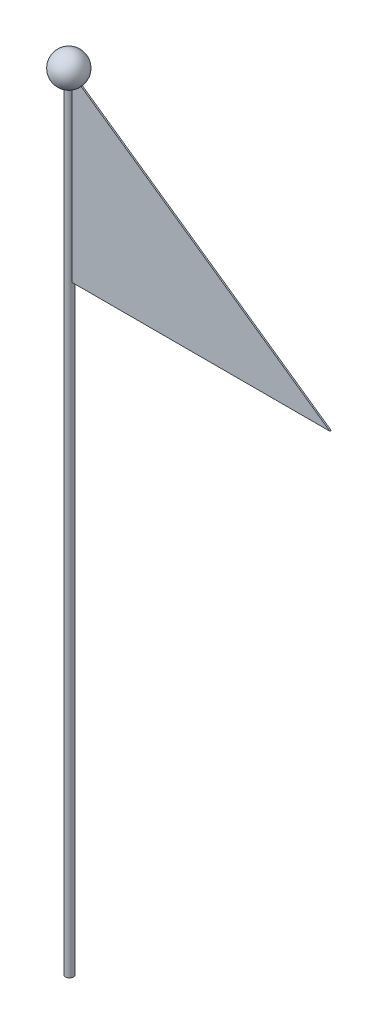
ISO-10303-21;
HEADER;
FILE_DESCRIPTION(('STEP AP214'),'2;1');
FILE_NAME('part.step','',(''),(''),'','','');
FILE_SCHEMA(('AUTOMOTIVE_DESIGN { 1 0 10303 214 1 1 1 1 }'));
ENDSEC;
DATA;
#1=APPLICATION_CONTEXT('core data for automotive mechanical design processes');
#2=APPLICATION_PROTOCOL_DEFINITION('international standard','automotive_design',2000,#1);
#3=PRODUCT_CONTEXT('',#1,'mechanical');
#4=PRODUCT('Part','Part','',(#3));
#5=PRODUCT_RELATED_PRODUCT_CATEGORY('part','',(#4));
#6=PRODUCT_DEFINITION_FORMATION('','',#4);
#7=PRODUCT_DEFINITION_CONTEXT('part definition',#1,'design');
#8=PRODUCT_DEFINITION('design','',#6,#7);
#9=PRODUCT_DEFINITION_SHAPE('','',#8);
#10=(LENGTH_UNIT() NAMED_UNIT(*) SI_UNIT(.MILLI.,.METRE.));
#11=(NAMED_UNIT(*) PLANE_ANGLE_UNIT() SI_UNIT($,.RADIAN.));
#12=(NAMED_UNIT(*) SI_UNIT($,.STERADIAN.) SOLID_ANGLE_UNIT());
#13=UNCERTAINTY_MEASURE_WITH_UNIT(LENGTH_MEASURE(1.E-05),#10,'distance_accuracy_value','');
#14=(GEOMETRIC_REPRESENTATION_CONTEXT(3) GLOBAL_UNCERTAINTY_ASSIGNED_CONTEXT((#13)) GLOBAL_UNIT_ASSIGNED_CONTEXT((#10,
#11,#12)) REPRESENTATION_CONTEXT('',''));
#15=CARTESIAN_POINT('',(0.,0.,0.));
#16=DIRECTION('',(0.,0.,1.));
#17=DIRECTION('',(1.,0.,0.));
#18=AXIS2_PLACEMENT_3D('',#15,#16,#17);
#19=CARTESIAN_POINT('',(0.,-600.,-0.5));
#20=DIRECTION('',(0.,1.,0.));
#21=DIRECTION('',(0.,0.,1.));
#22=AXIS2_PLACEMENT_3D('',#19,#20,#21);
#23=CYLINDRICAL_SURFACE('',#22,3.);
#24=CARTESIAN_POINT('',(-2.09833722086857,-11.5154653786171,-2.64405711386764));
#25=CARTESIAN_POINT('',(-2.21884287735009,-11.5205865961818,-2.52611061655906));
#26=CARTESIAN_POINT('',(-2.32946029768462,-11.526149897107,-2.39790363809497));
#27=CARTESIAN_POINT('',(-2.52766501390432,-11.5379977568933,-2.12464285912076));
#28=CARTESIAN_POINT('',(-2.61522414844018,-11.5442831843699,-1.97956876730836));
#29=CARTESIAN_POINT('',(-2.76468431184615,-11.5573867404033,-1.67685457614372));
#30=CARTESIAN_POINT('',(-2.8265984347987,-11.5642045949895,-1.51922093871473));
#31=CARTESIAN_POINT('',(-2.9230557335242,-11.5781775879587,-1.19585251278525));
#32=CARTESIAN_POINT('',(-2.95760572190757,-11.5853326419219,-1.03011975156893));
#33=CARTESIAN_POINT('',(-2.99840361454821,-11.5997821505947,-0.695106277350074));
#34=CARTESIAN_POINT('',(-3.00463386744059,-11.6070766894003,-0.525823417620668));
#35=CARTESIAN_POINT('',(-2.98856645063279,-11.6215939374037,-0.18860706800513));
#36=CARTESIAN_POINT('',(-2.96626759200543,-11.6288166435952,-0.0206736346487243));
#37=CARTESIAN_POINT('',(-2.89376190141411,-11.6429873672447,0.309104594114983));
#38=CARTESIAN_POINT('',(-2.84354944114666,-11.6499353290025,0.470948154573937));
#39=CARTESIAN_POINT('',(-2.71663113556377,-11.6633595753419,0.783911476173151));
#40=CARTESIAN_POINT('',(-2.63992537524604,-11.6698358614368,0.935031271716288));
#41=CARTESIAN_POINT('',(-2.46222387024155,-11.6821330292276,1.22219426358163));
#42=CARTESIAN_POINT('',(-2.36123718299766,-11.6879541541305,1.35824305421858));
#43=CARTESIAN_POINT('',(-2.13781899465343,-11.6987812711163,1.61145384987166));
#44=CARTESIAN_POINT('',(-2.0153876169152,-11.703787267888,1.72861596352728));
#45=CARTESIAN_POINT('',(-1.75265875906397,-11.7128411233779,1.94062664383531));
#46=CARTESIAN_POINT('',(-1.61237560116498,-11.7168897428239,2.03549292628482));
#47=CARTESIAN_POINT('',(-1.31784799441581,-11.7239215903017,2.20032503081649));
#48=CARTESIAN_POINT('',(-1.16360359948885,-11.7269048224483,2.27029094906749));
#49=CARTESIAN_POINT('',(-0.845676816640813,-11.7317210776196,2.38327361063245));
#50=CARTESIAN_POINT('',(-0.682002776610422,-11.7335551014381,2.42631380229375));
#51=CARTESIAN_POINT('',(-0.349744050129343,-11.7360263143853,2.48431209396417));
#52=CARTESIAN_POINT('',(-0.181159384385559,-11.73666350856,2.49927031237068));
#53=CARTESIAN_POINT('',(0.156032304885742,-11.7367234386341,2.50067707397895));
#54=CARTESIAN_POINT('',(0.324639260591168,-11.7361468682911,2.48714190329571));
#55=CARTESIAN_POINT('',(0.65718501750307,-11.7337966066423,2.43198143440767));
#56=CARTESIAN_POINT('',(0.821123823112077,-11.7320229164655,2.39035616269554));
#57=CARTESIAN_POINT('',(1.13967683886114,-11.7273274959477,2.28020472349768));
#58=CARTESIAN_POINT('',(1.29429132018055,-11.7244057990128,2.21167933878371));
#59=CARTESIAN_POINT('',(1.58981914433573,-11.7174951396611,2.04968045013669));
#60=CARTESIAN_POINT('',(1.73073245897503,-11.7135061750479,1.95620689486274));
#61=CARTESIAN_POINT('',(1.99493978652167,-11.7045690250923,1.746916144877));
#62=CARTESIAN_POINT('',(2.11822450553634,-11.6996203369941,1.63108723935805));
#63=CARTESIAN_POINT('',(2.34360075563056,-11.6889024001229,1.38041065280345));
#64=CARTESIAN_POINT('',(2.44569219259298,-11.6831331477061,1.24556288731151));
#65=CARTESIAN_POINT('',(2.62587747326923,-11.6709292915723,0.960553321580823));
#66=CARTESIAN_POINT('',(2.70395067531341,-11.6644941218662,0.810378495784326));
#67=CARTESIAN_POINT('',(2.83377744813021,-11.6511423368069,0.499073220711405));
#68=CARTESIAN_POINT('',(2.88553089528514,-11.6442257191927,0.337942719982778));
#69=CARTESIAN_POINT('',(2.96129046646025,-11.6300992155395,0.00915786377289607));
#70=CARTESIAN_POINT('',(2.9852737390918,-11.6228890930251,-0.158501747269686));
#71=CARTESIAN_POINT('',(3.00473964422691,-11.6083844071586,-0.495464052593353));
#72=CARTESIAN_POINT('',(3.00022217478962,-11.6010898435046,-0.664766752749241));
#73=CARTESIAN_POINT('',(2.96280599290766,-11.5866201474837,-1.00028593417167));
#74=CARTESIAN_POINT('',(2.9298950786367,-11.5794450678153,-1.16650105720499));
#75=CARTESIAN_POINT('',(2.83660509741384,-11.5654225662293,-1.49105006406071));
#76=CARTESIAN_POINT('',(2.77622605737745,-11.5585751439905,-1.64938395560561));
#77=CARTESIAN_POINT('',(2.62971826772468,-11.5454058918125,-1.95364619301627));
#78=CARTESIAN_POINT('',(2.54359361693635,-11.5390839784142,-2.09957650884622));
#79=CARTESIAN_POINT('',(2.34802806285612,-11.5271474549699,-2.3749072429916));
#80=CARTESIAN_POINT('',(2.23858719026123,-11.5215328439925,-2.50430768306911));
#81=CARTESIAN_POINT('',(1.99957430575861,-11.5111780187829,-2.7428074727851));
#82=CARTESIAN_POINT('',(1.87001622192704,-11.5064372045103,-2.8519207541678));
#83=CARTESIAN_POINT('',(1.59438855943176,-11.4979638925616,-3.04684434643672));
#84=CARTESIAN_POINT('',(1.44831902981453,-11.4942313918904,-3.13265472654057));
#85=CARTESIAN_POINT('',(1.14395616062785,-11.4878873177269,-3.27845508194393));
#86=CARTESIAN_POINT('',(0.985673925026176,-11.4852747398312,-3.33846819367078));
#87=CARTESIAN_POINT('',(0.661272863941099,-11.4812427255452,-3.43106959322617));
#88=CARTESIAN_POINT('',(0.495154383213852,-11.4798232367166,-3.46365908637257));
#89=CARTESIAN_POINT('',(0.159940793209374,-11.4782197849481,-3.50047122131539));
#90=CARTESIAN_POINT('',(-0.00915168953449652,-11.4780347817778,-3.50471774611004));
#91=CARTESIAN_POINT('',(-0.345694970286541,-11.4789032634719,-3.48478004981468));
#92=CARTESIAN_POINT('',(-0.513145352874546,-11.4799570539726,-3.46058881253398));
#93=CARTESIAN_POINT('',(-0.841630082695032,-11.4832723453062,-3.38445896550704));
#94=CARTESIAN_POINT('',(-1.0026627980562,-11.4855341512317,-3.33251334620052));
#95=CARTESIAN_POINT('',(-1.31357245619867,-11.4911978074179,-3.20238090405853));
#96=CARTESIAN_POINT('',(-1.46346258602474,-11.4945982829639,-3.12422572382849));
#97=CARTESIAN_POINT('',(-1.69431466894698,-11.5009579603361,-2.97797191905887));
#98=CARTESIAN_POINT('',(-1.77998880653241,-11.5036016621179,-2.91715679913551));
#99=CARTESIAN_POINT('',(-1.94449793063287,-11.5092616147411,-2.78690512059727));
#100=CARTESIAN_POINT('',(-2.0233329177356,-11.5122778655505,-2.71746856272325));
#101=CARTESIAN_POINT('',(-2.09833722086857,-11.5154653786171,-2.64405711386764));
#102=B_SPLINE_CURVE_WITH_KNOTS('',3,(#24,#25,#26,#27,#28,#29,#30,#31,#32,#33,#34,#35,#36,#37,
#38,#39,#40,#41,#42,#43,#44,#45,#46,#47,#48,#49,#50,#51,#52,#53,#54,#55,#56,#57,#58,#59,#60,#61,
#62,#63,#64,#65,#66,#67,#68,#69,#70,#71,#72,#73,#74,#75,#76,#77,#78,#79,#80,#81,#82,#83,#84,#85,
#86,#87,#88,#89,#90,#91,#92,#93,#94,#95,#96,#97,#98,#99,#100,#101),.UNSPECIFIED.,.T.,.F.,(4,2,2,
2,2,2,2,2,2,2,2,2,2,2,2,2,2,2,2,2,2,2,2,2,2,2,2,2,2,2,2,2,2,2,2,2,2,2,4),(0.,0.505712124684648,
1.01203904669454,1.51810712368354,2.02404916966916,2.53030652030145,3.03658496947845,
3.54296553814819,4.04934448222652,4.555534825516,5.06172225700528,5.56750611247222,
6.07328801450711,6.57862883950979,7.08396753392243,7.58901746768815,8.09406692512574,
8.59910168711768,9.10413748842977,9.60943857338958,10.1147419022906,10.6204782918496,
11.1262170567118,11.6323716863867,12.1385281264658,12.6449021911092,13.151275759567,
13.6575687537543,14.1638610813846,14.6698044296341,15.1757462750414,15.6812334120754,
16.1866983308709,16.6917372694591,17.1969008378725,17.7021920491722,18.2068754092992,
18.5216373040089,18.8363991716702),.UNSPECIFIED.);
#103=CARTESIAN_POINT('',(3.,-11.6081867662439,-0.5));
#104=VERTEX_POINT('',#103);
#105=CARTESIAN_POINT('',(2.82842712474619,-11.651180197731,0.5));
#106=VERTEX_POINT('',#105);
#107=EDGE_CURVE('E67',#104,#106,#102,.T.);
#108=ORIENTED_EDGE('',*,*,#107,.F.);
#109=DIRECTION('',(0.,1.,0.));
#110=VECTOR('',#109,1.);
#111=CARTESIAN_POINT('',(3.,-600.,-0.5));
#112=LINE('',#111,#110);
#113=CARTESIAN_POINT('',(3.,-140.,-0.5));
#114=VERTEX_POINT('',#113);
#115=EDGE_CURVE('E96',#114,#104,#112,.T.);
#116=ORIENTED_EDGE('',*,*,#115,.F.);
#117=CARTESIAN_POINT('',(0.,-140.,-0.5));
#118=DIRECTION('',(0.,-1.,0.));
#119=DIRECTION('',(0.,0.,-1.));
#120=AXIS2_PLACEMENT_3D('',#117,#118,#119);
#121=CIRCLE('',#120,3.);
#122=CARTESIAN_POINT('',(2.82842712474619,-140.,0.5));
#123=VERTEX_POINT('',#122);
#124=EDGE_CURVE('E133',#114,#123,#121,.T.);
#125=ORIENTED_EDGE('',*,*,#124,.T.);
#126=DIRECTION('',(0.,1.,0.));
#127=VECTOR('',#126,1.);
#128=CARTESIAN_POINT('',(2.82842712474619,-600.,0.5));
#129=LINE('',#128,#127);
#130=EDGE_CURVE('E52',#123,#106,#129,.T.);
#131=ORIENTED_EDGE('',*,*,#130,.T.);
#132=EDGE_LOOP('',(#108,#116,#125,#131));
#133=FACE_BOUND('',#132,.T.);
#134=CARTESIAN_POINT('',(0.,-600.,-0.5));
#135=DIRECTION('',(0.,1.,0.));
#136=DIRECTION('',(0.,0.,1.));
#137=AXIS2_PLACEMENT_3D('',#134,#135,#136);
#138=CIRCLE('',#137,3.);
#139=CARTESIAN_POINT('',(0.,-600.,2.5));
#140=VERTEX_POINT('',#139);
#141=EDGE_CURVE('E108',#140,#140,#138,.T.);
#142=ORIENTED_EDGE('',*,*,#141,.T.);
#143=EDGE_LOOP('',(#142));
#144=FACE_BOUND('',#143,.T.);
#145=ADVANCED_FACE('F43',(#133,#144),#23,.T.);
#146=CARTESIAN_POINT('',(0.,-600.,-0.5));
#147=DIRECTION('',(0.,1.,0.));
#148=DIRECTION('',(0.,0.,1.));
#149=AXIS2_PLACEMENT_3D('',#146,#147,#148);
#150=PLANE('',#149);
#151=ORIENTED_EDGE('',*,*,#141,.F.);
#152=EDGE_LOOP('',(#151));
#153=FACE_BOUND('',#152,.T.);
#154=ADVANCED_FACE('F121',(#153),#150,.F.);
#155=CARTESIAN_POINT('',(200.,-140.,-0.5));
#156=DIRECTION('',(0.573462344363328,0.819231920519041,0.));
#157=DIRECTION('',(-0.81923192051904,0.573462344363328,0.));
#158=AXIS2_PLACEMENT_3D('',#155,#156,#157);
#159=PLANE('',#158);
#160=CARTESIAN_POINT('',(0.,0.,0.));
#161=DIRECTION('',(0.573462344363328,0.819231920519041,0.));
#162=DIRECTION('',(-0.81923192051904,0.573462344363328,0.));
#163=AXIS2_PLACEMENT_3D('',#160,#161,#162);
#164=CIRCLE('',#163,12.);
#165=CARTESIAN_POINT('',(9.82224567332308,-6.87557197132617,0.5));
#166=VERTEX_POINT('',#165);
#167=CARTESIAN_POINT('',(9.82224567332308,-6.87557197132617,-0.5));
#168=VERTEX_POINT('',#167);
#169=EDGE_CURVE('E99',#166,#168,#164,.T.);
#170=ORIENTED_EDGE('',*,*,#169,.F.);
#171=DIRECTION('',(-0.819231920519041,0.573462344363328,0.));
#172=VECTOR('',#171,1.);
#173=CARTESIAN_POINT('',(200.,-140.,0.5));
#174=LINE('',#173,#172);
#175=CARTESIAN_POINT('',(200.,-140.,0.5));
#176=VERTEX_POINT('',#175);
#177=EDGE_CURVE('E87',#176,#166,#174,.T.);
#178=ORIENTED_EDGE('',*,*,#177,.F.);
#179=DIRECTION('',(0.,0.,1.));
#180=VECTOR('',#179,1.);
#181=CARTESIAN_POINT('',(200.,-140.,-0.5));
#182=LINE('',#181,#180);
#183=CARTESIAN_POINT('',(200.,-140.,-0.5));
#184=VERTEX_POINT('',#183);
#185=EDGE_CURVE('E147',#184,#176,#182,.T.);
#186=ORIENTED_EDGE('',*,*,#185,.F.);
#187=DIRECTION('',(-0.819231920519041,0.573462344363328,0.));
#188=VECTOR('',#187,1.);
#189=CARTESIAN_POINT('',(200.,-140.,-0.5));
#190=LINE('',#189,#188);
#191=EDGE_CURVE('E100',#184,#168,#190,.T.);
#192=ORIENTED_EDGE('',*,*,#191,.T.);
#193=EDGE_LOOP('',(#170,#178,#186,#192));
#194=FACE_BOUND('',#193,.T.);
#195=ADVANCED_FACE('F45',(#194),#159,.T.);
#196=CARTESIAN_POINT('',(0.,-140.,-0.5));
#197=DIRECTION('',(0.,-1.,0.));
#198=DIRECTION('',(0.,0.,-1.));
#199=AXIS2_PLACEMENT_3D('',#196,#197,#198);
#200=PLANE('',#199);
#201=ORIENTED_EDGE('',*,*,#124,.F.);
#202=DIRECTION('',(1.,0.,0.));
#203=VECTOR('',#202,1.);
#204=CARTESIAN_POINT('',(0.,-140.,-0.5));
#205=LINE('',#204,#203);
#206=EDGE_CURVE('E144',#114,#184,#205,.T.);
#207=ORIENTED_EDGE('',*,*,#206,.T.);
#208=ORIENTED_EDGE('',*,*,#185,.T.);
#209=DIRECTION('',(1.,0.,0.));
#210=VECTOR('',#209,1.);
#211=CARTESIAN_POINT('',(0.,-140.,0.5));
#212=LINE('',#211,#210);
#213=EDGE_CURVE('E91',#123,#176,#212,.T.);
#214=ORIENTED_EDGE('',*,*,#213,.F.);
#215=EDGE_LOOP('',(#201,#207,#208,#214));
#216=FACE_BOUND('',#215,.T.);
#217=ADVANCED_FACE('F128',(#216),#200,.T.);
#218=CARTESIAN_POINT('',(0.,0.,-0.5));
#219=DIRECTION('',(0.,0.,1.));
#220=DIRECTION('',(1.,0.,0.));
#221=AXIS2_PLACEMENT_3D('',#218,#219,#220);
#222=PLANE('',#221);
#223=ORIENTED_EDGE('',*,*,#115,.T.);
#224=CARTESIAN_POINT('',(0.,0.,-0.5));
#225=DIRECTION('',(0.,0.,1.));
#226=DIRECTION('',(1.,0.,0.));
#227=AXIS2_PLACEMENT_3D('',#224,#225,#226);
#228=CIRCLE('',#227,11.9895788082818);
#229=EDGE_CURVE('E59',#104,#168,#228,.T.);
#230=ORIENTED_EDGE('',*,*,#229,.T.);
#231=ORIENTED_EDGE('',*,*,#191,.F.);
#232=ORIENTED_EDGE('',*,*,#206,.F.);
#233=EDGE_LOOP('',(#223,#230,#231,#232));
#234=FACE_BOUND('',#233,.T.);
#235=ADVANCED_FACE('F152',(#234),#222,.F.);
#236=CARTESIAN_POINT('',(0.,0.,0.5));
#237=DIRECTION('',(0.,0.,1.));
#238=DIRECTION('',(1.,0.,0.));
#239=AXIS2_PLACEMENT_3D('',#236,#237,#238);
#240=PLANE('',#239);
#241=CARTESIAN_POINT('',(0.,0.,0.5));
#242=DIRECTION('',(0.,0.,1.));
#243=DIRECTION('',(1.,0.,0.));
#244=AXIS2_PLACEMENT_3D('',#241,#242,#243);
#245=CIRCLE('',#244,11.9895788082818);
#246=EDGE_CURVE('E11',#106,#166,#245,.T.);
#247=ORIENTED_EDGE('',*,*,#246,.F.);
#248=ORIENTED_EDGE('',*,*,#130,.F.);
#249=ORIENTED_EDGE('',*,*,#213,.T.);
#250=ORIENTED_EDGE('',*,*,#177,.T.);
#251=EDGE_LOOP('',(#247,#248,#249,#250));
#252=FACE_BOUND('',#251,.T.);
#253=ADVANCED_FACE('F89',(#252),#240,.T.);
#254=CARTESIAN_POINT('',(0.,0.,0.));
#255=DIRECTION('',(0.,1.,0.));
#256=DIRECTION('',(1.,0.,0.));
#257=AXIS2_PLACEMENT_3D('',#254,#255,#256);
#258=SPHERICAL_SURFACE('',#257,12.);
#259=ORIENTED_EDGE('',*,*,#229,.F.);
#260=ORIENTED_EDGE('',*,*,#107,.T.);
#261=ORIENTED_EDGE('',*,*,#246,.T.);
#262=ORIENTED_EDGE('',*,*,#169,.T.);
#263=EDGE_LOOP('',(#259,#260,#261,#262));
#264=FACE_BOUND('',#263,.T.);
#265=ADVANCED_FACE('F104',(#264),#258,.T.);
#266=CLOSED_SHELL('',(#145,#154,#195,#217,#235,#253,#265));
#267=MANIFOLD_SOLID_BREP('B2',#266);
#268=ADVANCED_BREP_SHAPE_REPRESENTATION('',(#18,#267),#14);
#269=SHAPE_DEFINITION_REPRESENTATION(#9,#268);
ENDSEC;
END-ISO-10303-21;
